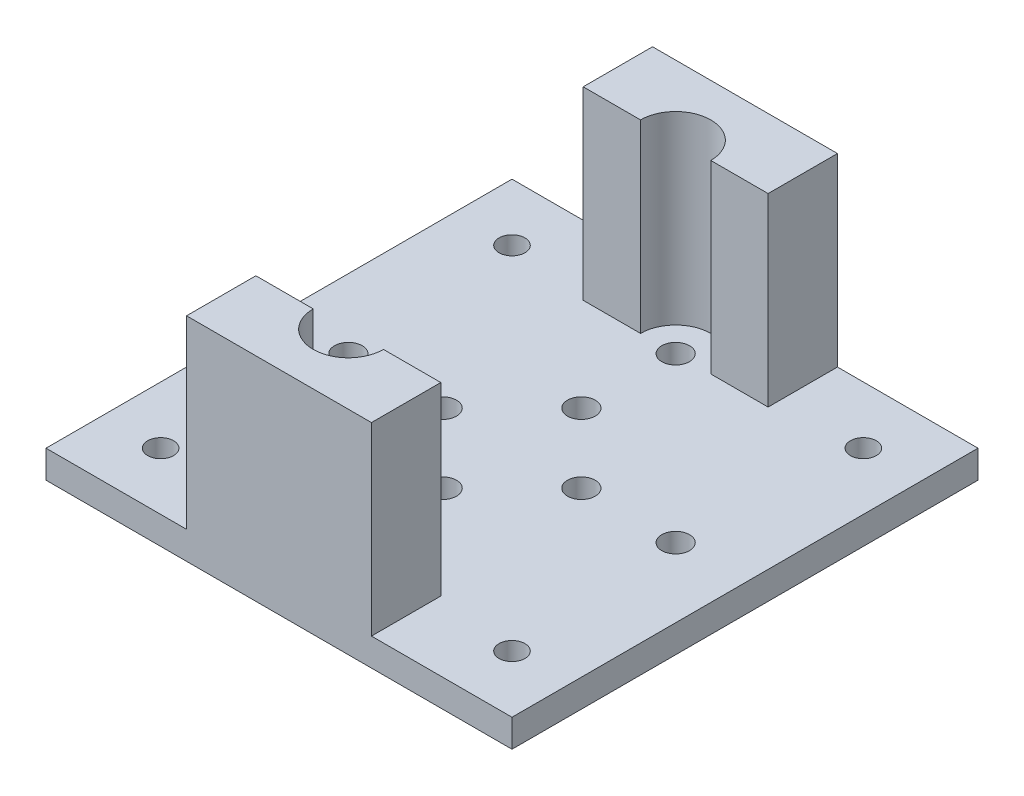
ISO-10303-21;
HEADER;
FILE_DESCRIPTION(('STEP AP214'),'2;1');
FILE_NAME('part.step','',(''),(''),'','','');
FILE_SCHEMA(('AUTOMOTIVE_DESIGN { 1 0 10303 214 1 1 1 1 }'));
ENDSEC;
DATA;
#1=APPLICATION_CONTEXT('core data for automotive mechanical design processes');
#2=APPLICATION_PROTOCOL_DEFINITION('international standard','automotive_design',2000,#1);
#3=PRODUCT_CONTEXT('',#1,'mechanical');
#4=PRODUCT('Part','Part','',(#3));
#5=PRODUCT_RELATED_PRODUCT_CATEGORY('part','',(#4));
#6=PRODUCT_DEFINITION_FORMATION('','',#4);
#7=PRODUCT_DEFINITION_CONTEXT('part definition',#1,'design');
#8=PRODUCT_DEFINITION('design','',#6,#7);
#9=PRODUCT_DEFINITION_SHAPE('','',#8);
#10=(LENGTH_UNIT() NAMED_UNIT(*) SI_UNIT(.MILLI.,.METRE.));
#11=(NAMED_UNIT(*) PLANE_ANGLE_UNIT() SI_UNIT($,.RADIAN.));
#12=(NAMED_UNIT(*) SI_UNIT($,.STERADIAN.) SOLID_ANGLE_UNIT());
#13=UNCERTAINTY_MEASURE_WITH_UNIT(LENGTH_MEASURE(1.E-05),#10,'distance_accuracy_value','');
#14=(GEOMETRIC_REPRESENTATION_CONTEXT(3) GLOBAL_UNCERTAINTY_ASSIGNED_CONTEXT((#13)) GLOBAL_UNIT_ASSIGNED_CONTEXT((#10,
#11,#12)) REPRESENTATION_CONTEXT('',''));
#15=CARTESIAN_POINT('',(0.,0.,0.));
#16=DIRECTION('',(0.,0.,1.));
#17=DIRECTION('',(1.,0.,0.));
#18=AXIS2_PLACEMENT_3D('',#15,#16,#17);
#19=CARTESIAN_POINT('',(0.,0.,0.));
#20=DIRECTION('',(0.,1.,0.));
#21=DIRECTION('',(0.,0.,1.));
#22=AXIS2_PLACEMENT_3D('',#19,#20,#21);
#23=PLANE('',#22);
#24=CARTESIAN_POINT('',(0.,0.,-7.5));
#25=DIRECTION('',(0.,1.,0.));
#26=DIRECTION('',(0.,0.,1.));
#27=AXIS2_PLACEMENT_3D('',#24,#25,#26);
#28=CIRCLE('',#27,1.5);
#29=CARTESIAN_POINT('',(0.,0.,-6.));
#30=VERTEX_POINT('',#29);
#31=EDGE_CURVE('E305',#30,#30,#28,.T.);
#32=ORIENTED_EDGE('',*,*,#31,.F.);
#33=EDGE_LOOP('',(#32));
#34=FACE_BOUND('',#33,.T.);
#35=CARTESIAN_POINT('',(7.5,0.,0.));
#36=DIRECTION('',(0.,1.,0.));
#37=DIRECTION('',(0.,0.,1.));
#38=AXIS2_PLACEMENT_3D('',#35,#36,#37);
#39=CIRCLE('',#38,1.5);
#40=CARTESIAN_POINT('',(7.5,0.,1.50000000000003));
#41=VERTEX_POINT('',#40);
#42=EDGE_CURVE('E368',#41,#41,#39,.T.);
#43=ORIENTED_EDGE('',*,*,#42,.F.);
#44=EDGE_LOOP('',(#43));
#45=FACE_BOUND('',#44,.T.);
#46=CARTESIAN_POINT('',(0.,0.,7.5));
#47=DIRECTION('',(0.,1.,0.));
#48=DIRECTION('',(0.,0.,1.));
#49=AXIS2_PLACEMENT_3D('',#46,#47,#48);
#50=CIRCLE('',#49,1.5);
#51=CARTESIAN_POINT('',(0.,0.,9.));
#52=VERTEX_POINT('',#51);
#53=EDGE_CURVE('E365',#52,#52,#50,.T.);
#54=ORIENTED_EDGE('',*,*,#53,.F.);
#55=EDGE_LOOP('',(#54));
#56=FACE_BOUND('',#55,.T.);
#57=CARTESIAN_POINT('',(-7.5,0.,0.));
#58=DIRECTION('',(0.,1.,0.));
#59=DIRECTION('',(0.,0.,1.));
#60=AXIS2_PLACEMENT_3D('',#57,#58,#59);
#61=CIRCLE('',#60,1.5);
#62=CARTESIAN_POINT('',(-7.5,0.,1.49999999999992));
#63=VERTEX_POINT('',#62);
#64=EDGE_CURVE('E362',#63,#63,#61,.T.);
#65=ORIENTED_EDGE('',*,*,#64,.F.);
#66=EDGE_LOOP('',(#65));
#67=FACE_BOUND('',#66,.T.);
#68=CARTESIAN_POINT('',(-18.9999999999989,0.,19.));
#69=DIRECTION('',(0.,1.,0.));
#70=DIRECTION('',(0.,0.,1.));
#71=AXIS2_PLACEMENT_3D('',#68,#69,#70);
#72=CIRCLE('',#71,1.4);
#73=CARTESIAN_POINT('',(-18.9999999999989,0.,20.4));
#74=VERTEX_POINT('',#73);
#75=EDGE_CURVE('E222',#74,#74,#72,.T.);
#76=ORIENTED_EDGE('',*,*,#75,.F.);
#77=EDGE_LOOP('',(#76));
#78=FACE_BOUND('',#77,.T.);
#79=CARTESIAN_POINT('',(19.0000000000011,0.,18.9999999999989));
#80=DIRECTION('',(0.,1.,0.));
#81=DIRECTION('',(0.,0.,1.));
#82=AXIS2_PLACEMENT_3D('',#79,#80,#81);
#83=CIRCLE('',#82,1.4);
#84=CARTESIAN_POINT('',(19.0000000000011,0.,20.3999999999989));
#85=VERTEX_POINT('',#84);
#86=EDGE_CURVE('E233',#85,#85,#83,.T.);
#87=ORIENTED_EDGE('',*,*,#86,.F.);
#88=EDGE_LOOP('',(#87));
#89=FACE_BOUND('',#88,.T.);
#90=CARTESIAN_POINT('',(19.,0.,-19.0000000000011));
#91=DIRECTION('',(0.,1.,0.));
#92=DIRECTION('',(0.,0.,1.));
#93=AXIS2_PLACEMENT_3D('',#90,#91,#92);
#94=CIRCLE('',#93,1.4);
#95=CARTESIAN_POINT('',(19.,0.,-17.6000000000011));
#96=VERTEX_POINT('',#95);
#97=EDGE_CURVE('E227',#96,#96,#94,.T.);
#98=ORIENTED_EDGE('',*,*,#97,.F.);
#99=EDGE_LOOP('',(#98));
#100=FACE_BOUND('',#99,.T.);
#101=CARTESIAN_POINT('',(-19.,0.,-19.));
#102=DIRECTION('',(0.,1.,0.));
#103=DIRECTION('',(0.,0.,1.));
#104=AXIS2_PLACEMENT_3D('',#101,#102,#103);
#105=CIRCLE('',#104,1.4);
#106=CARTESIAN_POINT('',(-19.,0.,-17.6));
#107=VERTEX_POINT('',#106);
#108=EDGE_CURVE('E226',#107,#107,#105,.T.);
#109=ORIENTED_EDGE('',*,*,#108,.F.);
#110=EDGE_LOOP('',(#109));
#111=FACE_BOUND('',#110,.T.);
#112=CARTESIAN_POINT('',(0.,0.,-17.7));
#113=DIRECTION('',(0.,1.,0.));
#114=DIRECTION('',(0.,0.,1.));
#115=AXIS2_PLACEMENT_3D('',#112,#113,#114);
#116=CIRCLE('',#115,1.5);
#117=CARTESIAN_POINT('',(0.,0.,-16.2));
#118=VERTEX_POINT('',#117);
#119=EDGE_CURVE('E277',#118,#118,#116,.T.);
#120=ORIENTED_EDGE('',*,*,#119,.F.);
#121=EDGE_LOOP('',(#120));
#122=FACE_BOUND('',#121,.T.);
#123=CARTESIAN_POINT('',(17.7,0.,0.));
#124=DIRECTION('',(0.,1.,0.));
#125=DIRECTION('',(0.,0.,1.));
#126=AXIS2_PLACEMENT_3D('',#123,#124,#125);
#127=CIRCLE('',#126,1.5);
#128=CARTESIAN_POINT('',(17.7,0.,1.50000000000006));
#129=VERTEX_POINT('',#128);
#130=EDGE_CURVE('E296',#129,#129,#127,.T.);
#131=ORIENTED_EDGE('',*,*,#130,.F.);
#132=EDGE_LOOP('',(#131));
#133=FACE_BOUND('',#132,.T.);
#134=CARTESIAN_POINT('',(1.00290147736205E-12,0.,17.7));
#135=DIRECTION('',(0.,1.,0.));
#136=DIRECTION('',(0.,0.,1.));
#137=AXIS2_PLACEMENT_3D('',#134,#135,#136);
#138=CIRCLE('',#137,1.50000000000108);
#139=CARTESIAN_POINT('',(1.00290147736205E-12,0.,19.2000000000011));
#140=VERTEX_POINT('',#139);
#141=EDGE_CURVE('E293',#140,#140,#138,.T.);
#142=ORIENTED_EDGE('',*,*,#141,.F.);
#143=EDGE_LOOP('',(#142));
#144=FACE_BOUND('',#143,.T.);
#145=CARTESIAN_POINT('',(-17.6999999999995,0.,5.03064256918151E-13));
#146=DIRECTION('',(0.,1.,0.));
#147=DIRECTION('',(0.,0.,1.));
#148=AXIS2_PLACEMENT_3D('',#145,#146,#147);
#149=CIRCLE('',#148,1.50000000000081);
#150=CARTESIAN_POINT('',(-17.6999999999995,0.,1.50000000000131));
#151=VERTEX_POINT('',#150);
#152=EDGE_CURVE('E250',#151,#151,#149,.T.);
#153=ORIENTED_EDGE('',*,*,#152,.F.);
#154=EDGE_LOOP('',(#153));
#155=FACE_BOUND('',#154,.T.);
#156=DIRECTION('',(1.,0.,0.));
#157=VECTOR('',#156,1.);
#158=CARTESIAN_POINT('',(-25.2,0.,25.2));
#159=LINE('',#158,#157);
#160=CARTESIAN_POINT('',(-25.2,0.,25.2));
#161=VERTEX_POINT('',#160);
#162=CARTESIAN_POINT('',(-10.,0.,25.2));
#163=VERTEX_POINT('',#162);
#164=EDGE_CURVE('E263',#161,#163,#159,.T.);
#165=ORIENTED_EDGE('',*,*,#164,.T.);
#166=DIRECTION('',(0.,0.,1.));
#167=VECTOR('',#166,1.);
#168=CARTESIAN_POINT('',(-10.,0.,17.7));
#169=LINE('',#168,#167);
#170=CARTESIAN_POINT('',(-10.,0.,17.7));
#171=VERTEX_POINT('',#170);
#172=EDGE_CURVE('E316',#171,#163,#169,.T.);
#173=ORIENTED_EDGE('',*,*,#172,.F.);
#174=DIRECTION('',(-1.,0.,0.));
#175=VECTOR('',#174,1.);
#176=CARTESIAN_POINT('',(-3.8,0.,17.7));
#177=LINE('',#176,#175);
#178=CARTESIAN_POINT('',(-3.8,0.,17.7));
#179=VERTEX_POINT('',#178);
#180=EDGE_CURVE('E314',#179,#171,#177,.T.);
#181=ORIENTED_EDGE('',*,*,#180,.F.);
#182=CARTESIAN_POINT('',(0.,0.,17.7));
#183=DIRECTION('',(0.,-1.,0.));
#184=DIRECTION('',(0.,0.,-1.));
#185=AXIS2_PLACEMENT_3D('',#182,#183,#184);
#186=CIRCLE('',#185,3.8);
#187=CARTESIAN_POINT('',(3.8,0.,17.7));
#188=VERTEX_POINT('',#187);
#189=EDGE_CURVE('E172',#188,#179,#186,.T.);
#190=ORIENTED_EDGE('',*,*,#189,.F.);
#191=DIRECTION('',(-1.,0.,0.));
#192=VECTOR('',#191,1.);
#193=CARTESIAN_POINT('',(10.,0.,17.7));
#194=LINE('',#193,#192);
#195=CARTESIAN_POINT('',(10.,0.,17.7));
#196=VERTEX_POINT('',#195);
#197=EDGE_CURVE('E168',#196,#188,#194,.T.);
#198=ORIENTED_EDGE('',*,*,#197,.F.);
#199=DIRECTION('',(0.,0.,-1.));
#200=VECTOR('',#199,1.);
#201=CARTESIAN_POINT('',(10.,0.,17.7));
#202=LINE('',#201,#200);
#203=CARTESIAN_POINT('',(10.,0.,25.2));
#204=VERTEX_POINT('',#203);
#205=EDGE_CURVE('E322',#204,#196,#202,.T.);
#206=ORIENTED_EDGE('',*,*,#205,.F.);
#207=CARTESIAN_POINT('',(25.2,0.,25.2));
#208=VERTEX_POINT('',#207);
#209=EDGE_CURVE('E283',#204,#208,#159,.T.);
#210=ORIENTED_EDGE('',*,*,#209,.T.);
#211=DIRECTION('',(0.,0.,-1.));
#212=VECTOR('',#211,1.);
#213=CARTESIAN_POINT('',(25.2,0.,-25.2));
#214=LINE('',#213,#212);
#215=CARTESIAN_POINT('',(25.2,0.,-25.2));
#216=VERTEX_POINT('',#215);
#217=EDGE_CURVE('E273',#208,#216,#214,.T.);
#218=ORIENTED_EDGE('',*,*,#217,.T.);
#219=DIRECTION('',(-1.,0.,0.));
#220=VECTOR('',#219,1.);
#221=CARTESIAN_POINT('',(-25.2,0.,-25.2));
#222=LINE('',#221,#220);
#223=CARTESIAN_POINT('',(10.,0.,-25.2));
#224=VERTEX_POINT('',#223);
#225=EDGE_CURVE('E278',#216,#224,#222,.T.);
#226=ORIENTED_EDGE('',*,*,#225,.T.);
#227=DIRECTION('',(0.,0.,-1.));
#228=VECTOR('',#227,1.);
#229=CARTESIAN_POINT('',(10.,0.,-17.7));
#230=LINE('',#229,#228);
#231=CARTESIAN_POINT('',(10.,0.,-17.7));
#232=VERTEX_POINT('',#231);
#233=EDGE_CURVE('E199',#232,#224,#230,.T.);
#234=ORIENTED_EDGE('',*,*,#233,.F.);
#235=DIRECTION('',(1.,0.,0.));
#236=VECTOR('',#235,1.);
#237=CARTESIAN_POINT('',(10.,0.,-17.7));
#238=LINE('',#237,#236);
#239=CARTESIAN_POINT('',(3.8,0.,-17.7));
#240=VERTEX_POINT('',#239);
#241=EDGE_CURVE('E177',#240,#232,#238,.T.);
#242=ORIENTED_EDGE('',*,*,#241,.F.);
#243=CARTESIAN_POINT('',(0.,0.,-17.7));
#244=DIRECTION('',(0.,-1.,0.));
#245=DIRECTION('',(0.,0.,1.));
#246=AXIS2_PLACEMENT_3D('',#243,#244,#245);
#247=CIRCLE('',#246,3.8);
#248=CARTESIAN_POINT('',(-3.8,0.,-17.7));
#249=VERTEX_POINT('',#248);
#250=EDGE_CURVE('E174',#249,#240,#247,.T.);
#251=ORIENTED_EDGE('',*,*,#250,.F.);
#252=DIRECTION('',(1.,0.,0.));
#253=VECTOR('',#252,1.);
#254=CARTESIAN_POINT('',(-3.8,0.,-17.7));
#255=LINE('',#254,#253);
#256=CARTESIAN_POINT('',(-10.,0.,-17.7));
#257=VERTEX_POINT('',#256);
#258=EDGE_CURVE('E59',#257,#249,#255,.T.);
#259=ORIENTED_EDGE('',*,*,#258,.F.);
#260=DIRECTION('',(0.,0.,1.));
#261=VECTOR('',#260,1.);
#262=CARTESIAN_POINT('',(-10.,0.,-17.7));
#263=LINE('',#262,#261);
#264=CARTESIAN_POINT('',(-10.,0.,-25.2));
#265=VERTEX_POINT('',#264);
#266=EDGE_CURVE('E202',#265,#257,#263,.T.);
#267=ORIENTED_EDGE('',*,*,#266,.F.);
#268=CARTESIAN_POINT('',(-25.2,0.,-25.2));
#269=VERTEX_POINT('',#268);
#270=EDGE_CURVE('E276',#265,#269,#222,.T.);
#271=ORIENTED_EDGE('',*,*,#270,.T.);
#272=DIRECTION('',(0.,0.,1.));
#273=VECTOR('',#272,1.);
#274=CARTESIAN_POINT('',(-25.2,0.,-25.2));
#275=LINE('',#274,#273);
#276=EDGE_CURVE('E280',#269,#161,#275,.T.);
#277=ORIENTED_EDGE('',*,*,#276,.T.);
#278=EDGE_LOOP('',(#165,#173,#181,#190,#198,#206,#210,#218,#226,#234,#242,#251,#259,#267,#271,#277));
#279=FACE_BOUND('',#278,.T.);
#280=ADVANCED_FACE('F34',(#34,#45,#56,#67,#78,#89,#100,#111,#122,#133,#144,#155,#279),#23,.T.);
#281=CARTESIAN_POINT('',(25.2,-3.,-25.2));
#282=DIRECTION('',(1.,0.,0.));
#283=DIRECTION('',(0.,0.,-1.));
#284=AXIS2_PLACEMENT_3D('',#281,#282,#283);
#285=PLANE('',#284);
#286=ORIENTED_EDGE('',*,*,#217,.F.);
#287=DIRECTION('',(0.,1.,0.));
#288=VECTOR('',#287,1.);
#289=CARTESIAN_POINT('',(25.2,-3.,25.2));
#290=LINE('',#289,#288);
#291=CARTESIAN_POINT('',(25.2,-3.,25.2));
#292=VERTEX_POINT('',#291);
#293=EDGE_CURVE('E11',#292,#208,#290,.T.);
#294=ORIENTED_EDGE('',*,*,#293,.F.);
#295=DIRECTION('',(0.,0.,-1.));
#296=VECTOR('',#295,1.);
#297=CARTESIAN_POINT('',(25.2,-3.,-25.2));
#298=LINE('',#297,#296);
#299=CARTESIAN_POINT('',(25.2,-3.,-25.2));
#300=VERTEX_POINT('',#299);
#301=EDGE_CURVE('E259',#292,#300,#298,.T.);
#302=ORIENTED_EDGE('',*,*,#301,.T.);
#303=DIRECTION('',(0.,1.,0.));
#304=VECTOR('',#303,1.);
#305=CARTESIAN_POINT('',(25.2,-3.,-25.2));
#306=LINE('',#305,#304);
#307=EDGE_CURVE('E272',#300,#216,#306,.T.);
#308=ORIENTED_EDGE('',*,*,#307,.T.);
#309=EDGE_LOOP('',(#286,#294,#302,#308));
#310=FACE_BOUND('',#309,.T.);
#311=ADVANCED_FACE('F36',(#310),#285,.T.);
#312=CARTESIAN_POINT('',(-25.2,-3.,25.2));
#313=DIRECTION('',(0.,0.,1.));
#314=DIRECTION('',(1.,0.,0.));
#315=AXIS2_PLACEMENT_3D('',#312,#313,#314);
#316=PLANE('',#315);
#317=ORIENTED_EDGE('',*,*,#164,.F.);
#318=DIRECTION('',(0.,1.,0.));
#319=VECTOR('',#318,1.);
#320=CARTESIAN_POINT('',(-25.2,-3.,25.2));
#321=LINE('',#320,#319);
#322=CARTESIAN_POINT('',(-25.2,-3.,25.2));
#323=VERTEX_POINT('',#322);
#324=EDGE_CURVE('E43',#323,#161,#321,.T.);
#325=ORIENTED_EDGE('',*,*,#324,.F.);
#326=DIRECTION('',(1.,0.,0.));
#327=VECTOR('',#326,1.);
#328=CARTESIAN_POINT('',(-25.2,-3.,25.2));
#329=LINE('',#328,#327);
#330=EDGE_CURVE('E269',#323,#292,#329,.T.);
#331=ORIENTED_EDGE('',*,*,#330,.T.);
#332=ORIENTED_EDGE('',*,*,#293,.T.);
#333=ORIENTED_EDGE('',*,*,#209,.F.);
#334=DIRECTION('',(0.,-1.,0.));
#335=VECTOR('',#334,1.);
#336=CARTESIAN_POINT('',(10.,20.,25.2));
#337=LINE('',#336,#335);
#338=CARTESIAN_POINT('',(10.,20.,25.2));
#339=VERTEX_POINT('',#338);
#340=EDGE_CURVE('E328',#339,#204,#337,.T.);
#341=ORIENTED_EDGE('',*,*,#340,.F.);
#342=DIRECTION('',(1.,0.,0.));
#343=VECTOR('',#342,1.);
#344=CARTESIAN_POINT('',(10.,20.,25.2));
#345=LINE('',#344,#343);
#346=CARTESIAN_POINT('',(-10.,20.,25.2));
#347=VERTEX_POINT('',#346);
#348=EDGE_CURVE('E336',#347,#339,#345,.T.);
#349=ORIENTED_EDGE('',*,*,#348,.F.);
#350=DIRECTION('',(0.,-1.,0.));
#351=VECTOR('',#350,1.);
#352=CARTESIAN_POINT('',(-10.,20.,25.2));
#353=LINE('',#352,#351);
#354=EDGE_CURVE('E179',#347,#163,#353,.T.);
#355=ORIENTED_EDGE('',*,*,#354,.T.);
#356=EDGE_LOOP('',(#317,#325,#331,#332,#333,#341,#349,#355));
#357=FACE_BOUND('',#356,.T.);
#358=ADVANCED_FACE('F334',(#357),#316,.T.);
#359=CARTESIAN_POINT('',(-25.2,-3.,-25.2));
#360=DIRECTION('',(-1.,0.,0.));
#361=DIRECTION('',(0.,0.,1.));
#362=AXIS2_PLACEMENT_3D('',#359,#360,#361);
#363=PLANE('',#362);
#364=ORIENTED_EDGE('',*,*,#276,.F.);
#365=DIRECTION('',(0.,1.,0.));
#366=VECTOR('',#365,1.);
#367=CARTESIAN_POINT('',(-25.2,-3.,-25.2));
#368=LINE('',#367,#366);
#369=CARTESIAN_POINT('',(-25.2,-3.,-25.2));
#370=VERTEX_POINT('',#369);
#371=EDGE_CURVE('E287',#370,#269,#368,.T.);
#372=ORIENTED_EDGE('',*,*,#371,.F.);
#373=DIRECTION('',(0.,0.,1.));
#374=VECTOR('',#373,1.);
#375=CARTESIAN_POINT('',(-25.2,-3.,-25.2));
#376=LINE('',#375,#374);
#377=EDGE_CURVE('E266',#370,#323,#376,.T.);
#378=ORIENTED_EDGE('',*,*,#377,.T.);
#379=ORIENTED_EDGE('',*,*,#324,.T.);
#380=EDGE_LOOP('',(#364,#372,#378,#379));
#381=FACE_BOUND('',#380,.T.);
#382=ADVANCED_FACE('F342',(#381),#363,.T.);
#383=CARTESIAN_POINT('',(-25.2,-3.,-25.2));
#384=DIRECTION('',(0.,0.,-1.));
#385=DIRECTION('',(-1.,0.,0.));
#386=AXIS2_PLACEMENT_3D('',#383,#384,#385);
#387=PLANE('',#386);
#388=ORIENTED_EDGE('',*,*,#225,.F.);
#389=ORIENTED_EDGE('',*,*,#307,.F.);
#390=DIRECTION('',(-1.,0.,0.));
#391=VECTOR('',#390,1.);
#392=CARTESIAN_POINT('',(-25.2,-3.,-25.2));
#393=LINE('',#392,#391);
#394=EDGE_CURVE('E262',#300,#370,#393,.T.);
#395=ORIENTED_EDGE('',*,*,#394,.T.);
#396=ORIENTED_EDGE('',*,*,#371,.T.);
#397=ORIENTED_EDGE('',*,*,#270,.F.);
#398=DIRECTION('',(0.,-1.,0.));
#399=VECTOR('',#398,1.);
#400=CARTESIAN_POINT('',(-10.,20.,-25.2));
#401=LINE('',#400,#399);
#402=CARTESIAN_POINT('',(-10.,20.,-25.2));
#403=VERTEX_POINT('',#402);
#404=EDGE_CURVE('E210',#403,#265,#401,.T.);
#405=ORIENTED_EDGE('',*,*,#404,.F.);
#406=DIRECTION('',(-1.,0.,0.));
#407=VECTOR('',#406,1.);
#408=CARTESIAN_POINT('',(10.,20.,-25.2));
#409=LINE('',#408,#407);
#410=CARTESIAN_POINT('',(10.,20.,-25.2));
#411=VERTEX_POINT('',#410);
#412=EDGE_CURVE('E190',#411,#403,#409,.T.);
#413=ORIENTED_EDGE('',*,*,#412,.F.);
#414=DIRECTION('',(0.,-1.,0.));
#415=VECTOR('',#414,1.);
#416=CARTESIAN_POINT('',(10.,20.,-25.2));
#417=LINE('',#416,#415);
#418=EDGE_CURVE('E213',#411,#224,#417,.T.);
#419=ORIENTED_EDGE('',*,*,#418,.T.);
#420=EDGE_LOOP('',(#388,#389,#395,#396,#397,#405,#413,#419));
#421=FACE_BOUND('',#420,.T.);
#422=ADVANCED_FACE('F410',(#421),#387,.T.);
#423=CARTESIAN_POINT('',(0.,-3.,0.));
#424=DIRECTION('',(0.,1.,0.));
#425=DIRECTION('',(0.,0.,1.));
#426=AXIS2_PLACEMENT_3D('',#423,#424,#425);
#427=PLANE('',#426);
#428=CARTESIAN_POINT('',(0.,-3.,-7.5));
#429=DIRECTION('',(0.,1.,0.));
#430=DIRECTION('',(0.,0.,1.));
#431=AXIS2_PLACEMENT_3D('',#428,#429,#430);
#432=CIRCLE('',#431,1.5);
#433=CARTESIAN_POINT('',(0.,-3.,-6.));
#434=VERTEX_POINT('',#433);
#435=EDGE_CURVE('E38',#434,#434,#432,.T.);
#436=ORIENTED_EDGE('',*,*,#435,.T.);
#437=EDGE_LOOP('',(#436));
#438=FACE_BOUND('',#437,.T.);
#439=CARTESIAN_POINT('',(7.5,-3.,0.));
#440=DIRECTION('',(0.,1.,0.));
#441=DIRECTION('',(0.,0.,1.));
#442=AXIS2_PLACEMENT_3D('',#439,#440,#441);
#443=CIRCLE('',#442,1.5);
#444=CARTESIAN_POINT('',(7.5,-3.,1.50000000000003));
#445=VERTEX_POINT('',#444);
#446=EDGE_CURVE('E307',#445,#445,#443,.T.);
#447=ORIENTED_EDGE('',*,*,#446,.T.);
#448=EDGE_LOOP('',(#447));
#449=FACE_BOUND('',#448,.T.);
#450=CARTESIAN_POINT('',(0.,-3.,7.5));
#451=DIRECTION('',(0.,1.,0.));
#452=DIRECTION('',(0.,0.,1.));
#453=AXIS2_PLACEMENT_3D('',#450,#451,#452);
#454=CIRCLE('',#453,1.5);
#455=CARTESIAN_POINT('',(0.,-3.,9.));
#456=VERTEX_POINT('',#455);
#457=EDGE_CURVE('E304',#456,#456,#454,.T.);
#458=ORIENTED_EDGE('',*,*,#457,.T.);
#459=EDGE_LOOP('',(#458));
#460=FACE_BOUND('',#459,.T.);
#461=CARTESIAN_POINT('',(-7.5,-3.,0.));
#462=DIRECTION('',(0.,1.,0.));
#463=DIRECTION('',(0.,0.,1.));
#464=AXIS2_PLACEMENT_3D('',#461,#462,#463);
#465=CIRCLE('',#464,1.5);
#466=CARTESIAN_POINT('',(-7.5,-3.,1.49999999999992));
#467=VERTEX_POINT('',#466);
#468=EDGE_CURVE('E301',#467,#467,#465,.T.);
#469=ORIENTED_EDGE('',*,*,#468,.T.);
#470=EDGE_LOOP('',(#469));
#471=FACE_BOUND('',#470,.T.);
#472=CARTESIAN_POINT('',(-18.9999999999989,-3.,19.));
#473=DIRECTION('',(0.,1.,0.));
#474=DIRECTION('',(0.,0.,1.));
#475=AXIS2_PLACEMENT_3D('',#472,#473,#474);
#476=CIRCLE('',#475,1.4);
#477=CARTESIAN_POINT('',(-18.9999999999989,-3.,20.4));
#478=VERTEX_POINT('',#477);
#479=EDGE_CURVE('E236',#478,#478,#476,.T.);
#480=ORIENTED_EDGE('',*,*,#479,.T.);
#481=EDGE_LOOP('',(#480));
#482=FACE_BOUND('',#481,.T.);
#483=CARTESIAN_POINT('',(19.0000000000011,-3.,18.9999999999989));
#484=DIRECTION('',(0.,1.,0.));
#485=DIRECTION('',(0.,0.,1.));
#486=AXIS2_PLACEMENT_3D('',#483,#484,#485);
#487=CIRCLE('',#486,1.4);
#488=CARTESIAN_POINT('',(19.0000000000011,-3.,20.3999999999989));
#489=VERTEX_POINT('',#488);
#490=EDGE_CURVE('E230',#489,#489,#487,.T.);
#491=ORIENTED_EDGE('',*,*,#490,.T.);
#492=EDGE_LOOP('',(#491));
#493=FACE_BOUND('',#492,.T.);
#494=CARTESIAN_POINT('',(19.,-3.,-19.0000000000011));
#495=DIRECTION('',(0.,1.,0.));
#496=DIRECTION('',(0.,0.,1.));
#497=AXIS2_PLACEMENT_3D('',#494,#495,#496);
#498=CIRCLE('',#497,1.4);
#499=CARTESIAN_POINT('',(19.,-3.,-17.6000000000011));
#500=VERTEX_POINT('',#499);
#501=EDGE_CURVE('E223',#500,#500,#498,.T.);
#502=ORIENTED_EDGE('',*,*,#501,.T.);
#503=EDGE_LOOP('',(#502));
#504=FACE_BOUND('',#503,.T.);
#505=CARTESIAN_POINT('',(-19.,-3.,-19.));
#506=DIRECTION('',(0.,1.,0.));
#507=DIRECTION('',(0.,0.,1.));
#508=AXIS2_PLACEMENT_3D('',#505,#506,#507);
#509=CIRCLE('',#508,1.4);
#510=CARTESIAN_POINT('',(-19.,-3.,-17.6));
#511=VERTEX_POINT('',#510);
#512=EDGE_CURVE('E241',#511,#511,#509,.T.);
#513=ORIENTED_EDGE('',*,*,#512,.T.);
#514=EDGE_LOOP('',(#513));
#515=FACE_BOUND('',#514,.T.);
#516=CARTESIAN_POINT('',(0.,-3.,-17.7));
#517=DIRECTION('',(0.,1.,0.));
#518=DIRECTION('',(0.,0.,1.));
#519=AXIS2_PLACEMENT_3D('',#516,#517,#518);
#520=CIRCLE('',#519,1.5);
#521=CARTESIAN_POINT('',(0.,-3.,-16.2));
#522=VERTEX_POINT('',#521);
#523=EDGE_CURVE('E247',#522,#522,#520,.T.);
#524=ORIENTED_EDGE('',*,*,#523,.T.);
#525=EDGE_LOOP('',(#524));
#526=FACE_BOUND('',#525,.T.);
#527=CARTESIAN_POINT('',(17.7,-3.,0.));
#528=DIRECTION('',(0.,1.,0.));
#529=DIRECTION('',(0.,0.,1.));
#530=AXIS2_PLACEMENT_3D('',#527,#528,#529);
#531=CIRCLE('',#530,1.5);
#532=CARTESIAN_POINT('',(17.7,-3.,1.50000000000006));
#533=VERTEX_POINT('',#532);
#534=EDGE_CURVE('E251',#533,#533,#531,.T.);
#535=ORIENTED_EDGE('',*,*,#534,.T.);
#536=EDGE_LOOP('',(#535));
#537=FACE_BOUND('',#536,.T.);
#538=CARTESIAN_POINT('',(1.00290147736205E-12,-3.,17.7));
#539=DIRECTION('',(0.,1.,0.));
#540=DIRECTION('',(0.,0.,1.));
#541=AXIS2_PLACEMENT_3D('',#538,#539,#540);
#542=CIRCLE('',#541,1.50000000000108);
#543=CARTESIAN_POINT('',(1.00290147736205E-12,-3.,19.2000000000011));
#544=VERTEX_POINT('',#543);
#545=EDGE_CURVE('E254',#544,#544,#542,.T.);
#546=ORIENTED_EDGE('',*,*,#545,.T.);
#547=EDGE_LOOP('',(#546));
#548=FACE_BOUND('',#547,.T.);
#549=CARTESIAN_POINT('',(-17.6999999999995,-3.,5.03064256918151E-13));
#550=DIRECTION('',(0.,1.,0.));
#551=DIRECTION('',(0.,0.,1.));
#552=AXIS2_PLACEMENT_3D('',#549,#550,#551);
#553=CIRCLE('',#552,1.50000000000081);
#554=CARTESIAN_POINT('',(-17.6999999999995,-3.,1.50000000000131));
#555=VERTEX_POINT('',#554);
#556=EDGE_CURVE('E244',#555,#555,#553,.T.);
#557=ORIENTED_EDGE('',*,*,#556,.T.);
#558=EDGE_LOOP('',(#557));
#559=FACE_BOUND('',#558,.T.);
#560=ORIENTED_EDGE('',*,*,#301,.F.);
#561=ORIENTED_EDGE('',*,*,#330,.F.);
#562=ORIENTED_EDGE('',*,*,#377,.F.);
#563=ORIENTED_EDGE('',*,*,#394,.F.);
#564=EDGE_LOOP('',(#560,#561,#562,#563));
#565=FACE_BOUND('',#564,.T.);
#566=ADVANCED_FACE('F349',(#438,#449,#460,#471,#482,#493,#504,#515,#526,#537,#548,#559,#565),
#427,.F.);
#567=CARTESIAN_POINT('',(-17.6999999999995,-3.,5.03064256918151E-13));
#568=DIRECTION('',(0.,1.,0.));
#569=DIRECTION('',(0.,0.,1.));
#570=AXIS2_PLACEMENT_3D('',#567,#568,#569);
#571=CYLINDRICAL_SURFACE('',#570,1.50000000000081);
#572=ORIENTED_EDGE('',*,*,#152,.T.);
#573=EDGE_LOOP('',(#572));
#574=FACE_BOUND('',#573,.T.);
#575=ORIENTED_EDGE('',*,*,#556,.F.);
#576=EDGE_LOOP('',(#575));
#577=FACE_BOUND('',#576,.T.);
#578=ADVANCED_FACE('F402',(#574,#577),#571,.F.);
#579=CARTESIAN_POINT('',(1.00290147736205E-12,-3.,17.7));
#580=DIRECTION('',(0.,1.,0.));
#581=DIRECTION('',(0.,0.,1.));
#582=AXIS2_PLACEMENT_3D('',#579,#580,#581);
#583=CYLINDRICAL_SURFACE('',#582,1.50000000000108);
#584=ORIENTED_EDGE('',*,*,#141,.T.);
#585=EDGE_LOOP('',(#584));
#586=FACE_BOUND('',#585,.T.);
#587=ORIENTED_EDGE('',*,*,#545,.F.);
#588=EDGE_LOOP('',(#587));
#589=FACE_BOUND('',#588,.T.);
#590=ADVANCED_FACE('F405',(#586,#589),#583,.F.);
#591=CARTESIAN_POINT('',(17.7,-3.,0.));
#592=DIRECTION('',(0.,1.,0.));
#593=DIRECTION('',(0.,0.,1.));
#594=AXIS2_PLACEMENT_3D('',#591,#592,#593);
#595=CYLINDRICAL_SURFACE('',#594,1.5);
#596=ORIENTED_EDGE('',*,*,#130,.T.);
#597=EDGE_LOOP('',(#596));
#598=FACE_BOUND('',#597,.T.);
#599=ORIENTED_EDGE('',*,*,#534,.F.);
#600=EDGE_LOOP('',(#599));
#601=FACE_BOUND('',#600,.T.);
#602=ADVANCED_FACE('F620',(#598,#601),#595,.F.);
#603=CARTESIAN_POINT('',(0.,-3.,-17.7));
#604=DIRECTION('',(0.,1.,0.));
#605=DIRECTION('',(0.,0.,1.));
#606=AXIS2_PLACEMENT_3D('',#603,#604,#605);
#607=CYLINDRICAL_SURFACE('',#606,1.5);
#608=ORIENTED_EDGE('',*,*,#119,.T.);
#609=EDGE_LOOP('',(#608));
#610=FACE_BOUND('',#609,.T.);
#611=ORIENTED_EDGE('',*,*,#523,.F.);
#612=EDGE_LOOP('',(#611));
#613=FACE_BOUND('',#612,.T.);
#614=ADVANCED_FACE('F616',(#610,#613),#607,.F.);
#615=CARTESIAN_POINT('',(-19.,-3.,-19.));
#616=DIRECTION('',(0.,1.,0.));
#617=DIRECTION('',(0.,0.,1.));
#618=AXIS2_PLACEMENT_3D('',#615,#616,#617);
#619=CYLINDRICAL_SURFACE('',#618,1.4);
#620=ORIENTED_EDGE('',*,*,#512,.F.);
#621=EDGE_LOOP('',(#620));
#622=FACE_BOUND('',#621,.T.);
#623=ORIENTED_EDGE('',*,*,#108,.T.);
#624=EDGE_LOOP('',(#623));
#625=FACE_BOUND('',#624,.T.);
#626=ADVANCED_FACE('F607',(#622,#625),#619,.F.);
#627=CARTESIAN_POINT('',(19.,-3.,-19.0000000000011));
#628=DIRECTION('',(0.,1.,0.));
#629=DIRECTION('',(0.,0.,1.));
#630=AXIS2_PLACEMENT_3D('',#627,#628,#629);
#631=CYLINDRICAL_SURFACE('',#630,1.4);
#632=ORIENTED_EDGE('',*,*,#501,.F.);
#633=EDGE_LOOP('',(#632));
#634=FACE_BOUND('',#633,.T.);
#635=ORIENTED_EDGE('',*,*,#97,.T.);
#636=EDGE_LOOP('',(#635));
#637=FACE_BOUND('',#636,.T.);
#638=ADVANCED_FACE('F603',(#634,#637),#631,.F.);
#639=CARTESIAN_POINT('',(19.0000000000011,-3.,18.9999999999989));
#640=DIRECTION('',(0.,1.,0.));
#641=DIRECTION('',(0.,0.,1.));
#642=AXIS2_PLACEMENT_3D('',#639,#640,#641);
#643=CYLINDRICAL_SURFACE('',#642,1.4);
#644=ORIENTED_EDGE('',*,*,#490,.F.);
#645=EDGE_LOOP('',(#644));
#646=FACE_BOUND('',#645,.T.);
#647=ORIENTED_EDGE('',*,*,#86,.T.);
#648=EDGE_LOOP('',(#647));
#649=FACE_BOUND('',#648,.T.);
#650=ADVANCED_FACE('F606',(#646,#649),#643,.F.);
#651=CARTESIAN_POINT('',(-18.9999999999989,-3.,19.));
#652=DIRECTION('',(0.,1.,0.));
#653=DIRECTION('',(0.,0.,1.));
#654=AXIS2_PLACEMENT_3D('',#651,#652,#653);
#655=CYLINDRICAL_SURFACE('',#654,1.4);
#656=ORIENTED_EDGE('',*,*,#479,.F.);
#657=EDGE_LOOP('',(#656));
#658=FACE_BOUND('',#657,.T.);
#659=ORIENTED_EDGE('',*,*,#75,.T.);
#660=EDGE_LOOP('',(#659));
#661=FACE_BOUND('',#660,.T.);
#662=ADVANCED_FACE('F447',(#658,#661),#655,.F.);
#663=CARTESIAN_POINT('',(0.,20.,-17.7));
#664=DIRECTION('',(0.,-1.,0.));
#665=DIRECTION('',(0.,0.,-1.));
#666=AXIS2_PLACEMENT_3D('',#663,#664,#665);
#667=CYLINDRICAL_SURFACE('',#666,3.8);
#668=ORIENTED_EDGE('',*,*,#250,.T.);
#669=DIRECTION('',(0.,-1.,0.));
#670=VECTOR('',#669,1.);
#671=CARTESIAN_POINT('',(3.8,20.,-17.7));
#672=LINE('',#671,#670);
#673=CARTESIAN_POINT('',(3.8,20.,-17.7));
#674=VERTEX_POINT('',#673);
#675=EDGE_CURVE('E219',#674,#240,#672,.T.);
#676=ORIENTED_EDGE('',*,*,#675,.F.);
#677=CARTESIAN_POINT('',(0.,20.,-17.7));
#678=DIRECTION('',(0.,-1.,0.));
#679=DIRECTION('',(0.,0.,1.));
#680=AXIS2_PLACEMENT_3D('',#677,#678,#679);
#681=CIRCLE('',#680,3.8);
#682=CARTESIAN_POINT('',(-3.8,20.,-17.7));
#683=VERTEX_POINT('',#682);
#684=EDGE_CURVE('E183',#683,#674,#681,.T.);
#685=ORIENTED_EDGE('',*,*,#684,.F.);
#686=DIRECTION('',(0.,-1.,0.));
#687=VECTOR('',#686,1.);
#688=CARTESIAN_POINT('',(-3.8,20.,-17.7));
#689=LINE('',#688,#687);
#690=EDGE_CURVE('E195',#683,#249,#689,.T.);
#691=ORIENTED_EDGE('',*,*,#690,.T.);
#692=EDGE_LOOP('',(#668,#676,#685,#691));
#693=FACE_BOUND('',#692,.T.);
#694=ADVANCED_FACE('F442',(#693),#667,.F.);
#695=CARTESIAN_POINT('',(10.,20.,-17.7));
#696=DIRECTION('',(0.,0.,-1.));
#697=DIRECTION('',(-1.,0.,0.));
#698=AXIS2_PLACEMENT_3D('',#695,#696,#697);
#699=PLANE('',#698);
#700=ORIENTED_EDGE('',*,*,#241,.T.);
#701=DIRECTION('',(0.,-1.,0.));
#702=VECTOR('',#701,1.);
#703=CARTESIAN_POINT('',(10.,20.,-17.7));
#704=LINE('',#703,#702);
#705=CARTESIAN_POINT('',(10.,20.,-17.7));
#706=VERTEX_POINT('',#705);
#707=EDGE_CURVE('E216',#706,#232,#704,.T.);
#708=ORIENTED_EDGE('',*,*,#707,.F.);
#709=DIRECTION('',(1.,0.,0.));
#710=VECTOR('',#709,1.);
#711=CARTESIAN_POINT('',(10.,20.,-17.7));
#712=LINE('',#711,#710);
#713=EDGE_CURVE('E186',#674,#706,#712,.T.);
#714=ORIENTED_EDGE('',*,*,#713,.F.);
#715=ORIENTED_EDGE('',*,*,#675,.T.);
#716=EDGE_LOOP('',(#700,#708,#714,#715));
#717=FACE_BOUND('',#716,.T.);
#718=ADVANCED_FACE('F446',(#717),#699,.F.);
#719=CARTESIAN_POINT('',(10.,20.,-17.7));
#720=DIRECTION('',(-1.,0.,0.));
#721=DIRECTION('',(0.,0.,1.));
#722=AXIS2_PLACEMENT_3D('',#719,#720,#721);
#723=PLANE('',#722);
#724=ORIENTED_EDGE('',*,*,#233,.T.);
#725=ORIENTED_EDGE('',*,*,#418,.F.);
#726=DIRECTION('',(0.,0.,-1.));
#727=VECTOR('',#726,1.);
#728=CARTESIAN_POINT('',(10.,20.,-17.7));
#729=LINE('',#728,#727);
#730=EDGE_CURVE('E188',#706,#411,#729,.T.);
#731=ORIENTED_EDGE('',*,*,#730,.F.);
#732=ORIENTED_EDGE('',*,*,#707,.T.);
#733=EDGE_LOOP('',(#724,#725,#731,#732));
#734=FACE_BOUND('',#733,.T.);
#735=ADVANCED_FACE('F458',(#734),#723,.F.);
#736=CARTESIAN_POINT('',(-10.,20.,-17.7));
#737=DIRECTION('',(1.,0.,0.));
#738=DIRECTION('',(0.,0.,-1.));
#739=AXIS2_PLACEMENT_3D('',#736,#737,#738);
#740=PLANE('',#739);
#741=ORIENTED_EDGE('',*,*,#266,.T.);
#742=DIRECTION('',(0.,-1.,0.));
#743=VECTOR('',#742,1.);
#744=CARTESIAN_POINT('',(-10.,20.,-17.7));
#745=LINE('',#744,#743);
#746=CARTESIAN_POINT('',(-10.,20.,-17.7));
#747=VERTEX_POINT('',#746);
#748=EDGE_CURVE('E207',#747,#257,#745,.T.);
#749=ORIENTED_EDGE('',*,*,#748,.F.);
#750=DIRECTION('',(0.,0.,1.));
#751=VECTOR('',#750,1.);
#752=CARTESIAN_POINT('',(-10.,20.,-17.7));
#753=LINE('',#752,#751);
#754=EDGE_CURVE('E192',#403,#747,#753,.T.);
#755=ORIENTED_EDGE('',*,*,#754,.F.);
#756=ORIENTED_EDGE('',*,*,#404,.T.);
#757=EDGE_LOOP('',(#741,#749,#755,#756));
#758=FACE_BOUND('',#757,.T.);
#759=ADVANCED_FACE('F468',(#758),#740,.F.);
#760=CARTESIAN_POINT('',(-3.8,20.,-17.7));
#761=DIRECTION('',(0.,0.,-1.));
#762=DIRECTION('',(-1.,0.,0.));
#763=AXIS2_PLACEMENT_3D('',#760,#761,#762);
#764=PLANE('',#763);
#765=ORIENTED_EDGE('',*,*,#258,.T.);
#766=ORIENTED_EDGE('',*,*,#690,.F.);
#767=DIRECTION('',(1.,0.,0.));
#768=VECTOR('',#767,1.);
#769=CARTESIAN_POINT('',(-3.8,20.,-17.7));
#770=LINE('',#769,#768);
#771=EDGE_CURVE('E194',#747,#683,#770,.T.);
#772=ORIENTED_EDGE('',*,*,#771,.F.);
#773=ORIENTED_EDGE('',*,*,#748,.T.);
#774=EDGE_LOOP('',(#765,#766,#772,#773));
#775=FACE_BOUND('',#774,.T.);
#776=ADVANCED_FACE('F478',(#775),#764,.F.);
#777=CARTESIAN_POINT('',(0.,20.,-17.7));
#778=DIRECTION('',(0.,1.,0.));
#779=DIRECTION('',(0.,0.,1.));
#780=AXIS2_PLACEMENT_3D('',#777,#778,#779);
#781=PLANE('',#780);
#782=ORIENTED_EDGE('',*,*,#684,.T.);
#783=ORIENTED_EDGE('',*,*,#713,.T.);
#784=ORIENTED_EDGE('',*,*,#730,.T.);
#785=ORIENTED_EDGE('',*,*,#412,.T.);
#786=ORIENTED_EDGE('',*,*,#754,.T.);
#787=ORIENTED_EDGE('',*,*,#771,.T.);
#788=EDGE_LOOP('',(#782,#783,#784,#785,#786,#787));
#789=FACE_BOUND('',#788,.T.);
#790=ADVANCED_FACE('F488',(#789),#781,.T.);
#791=CARTESIAN_POINT('',(0.,20.,17.7));
#792=DIRECTION('',(0.,-1.,0.));
#793=DIRECTION('',(0.,0.,-1.));
#794=AXIS2_PLACEMENT_3D('',#791,#792,#793);
#795=CYLINDRICAL_SURFACE('',#794,3.8);
#796=ORIENTED_EDGE('',*,*,#189,.T.);
#797=DIRECTION('',(0.,-1.,0.));
#798=VECTOR('',#797,1.);
#799=CARTESIAN_POINT('',(-3.8,20.,17.7));
#800=LINE('',#799,#798);
#801=CARTESIAN_POINT('',(-3.8,20.,17.7));
#802=VERTEX_POINT('',#801);
#803=EDGE_CURVE('E153',#802,#179,#800,.T.);
#804=ORIENTED_EDGE('',*,*,#803,.F.);
#805=CARTESIAN_POINT('',(0.,20.,17.7));
#806=DIRECTION('',(0.,-1.,0.));
#807=DIRECTION('',(0.,0.,-1.));
#808=AXIS2_PLACEMENT_3D('',#805,#806,#807);
#809=CIRCLE('',#808,3.8);
#810=CARTESIAN_POINT('',(3.8,20.,17.7));
#811=VERTEX_POINT('',#810);
#812=EDGE_CURVE('E160',#811,#802,#809,.T.);
#813=ORIENTED_EDGE('',*,*,#812,.F.);
#814=DIRECTION('',(0.,-1.,0.));
#815=VECTOR('',#814,1.);
#816=CARTESIAN_POINT('',(3.8,20.,17.7));
#817=LINE('',#816,#815);
#818=EDGE_CURVE('E325',#811,#188,#817,.T.);
#819=ORIENTED_EDGE('',*,*,#818,.T.);
#820=EDGE_LOOP('',(#796,#804,#813,#819));
#821=FACE_BOUND('',#820,.T.);
#822=ADVANCED_FACE('F170',(#821),#795,.F.);
#823=CARTESIAN_POINT('',(-3.8,20.,17.7));
#824=DIRECTION('',(0.,0.,1.));
#825=DIRECTION('',(1.,0.,0.));
#826=AXIS2_PLACEMENT_3D('',#823,#824,#825);
#827=PLANE('',#826);
#828=ORIENTED_EDGE('',*,*,#180,.T.);
#829=DIRECTION('',(0.,-1.,0.));
#830=VECTOR('',#829,1.);
#831=CARTESIAN_POINT('',(-10.,20.,17.7));
#832=LINE('',#831,#830);
#833=CARTESIAN_POINT('',(-10.,20.,17.7));
#834=VERTEX_POINT('',#833);
#835=EDGE_CURVE('E156',#834,#171,#832,.T.);
#836=ORIENTED_EDGE('',*,*,#835,.F.);
#837=DIRECTION('',(-1.,0.,0.));
#838=VECTOR('',#837,1.);
#839=CARTESIAN_POINT('',(-3.8,20.,17.7));
#840=LINE('',#839,#838);
#841=EDGE_CURVE('E149',#802,#834,#840,.T.);
#842=ORIENTED_EDGE('',*,*,#841,.F.);
#843=ORIENTED_EDGE('',*,*,#803,.T.);
#844=EDGE_LOOP('',(#828,#836,#842,#843));
#845=FACE_BOUND('',#844,.T.);
#846=ADVANCED_FACE('F151',(#845),#827,.F.);
#847=CARTESIAN_POINT('',(-10.,20.,17.7));
#848=DIRECTION('',(1.,0.,0.));
#849=DIRECTION('',(0.,0.,-1.));
#850=AXIS2_PLACEMENT_3D('',#847,#848,#849);
#851=PLANE('',#850);
#852=ORIENTED_EDGE('',*,*,#172,.T.);
#853=ORIENTED_EDGE('',*,*,#354,.F.);
#854=DIRECTION('',(0.,0.,1.));
#855=VECTOR('',#854,1.);
#856=CARTESIAN_POINT('',(-10.,20.,17.7));
#857=LINE('',#856,#855);
#858=EDGE_CURVE('E159',#834,#347,#857,.T.);
#859=ORIENTED_EDGE('',*,*,#858,.F.);
#860=ORIENTED_EDGE('',*,*,#835,.T.);
#861=EDGE_LOOP('',(#852,#853,#859,#860));
#862=FACE_BOUND('',#861,.T.);
#863=ADVANCED_FACE('F515',(#862),#851,.F.);
#864=CARTESIAN_POINT('',(10.,20.,17.7));
#865=DIRECTION('',(-1.,0.,0.));
#866=DIRECTION('',(0.,0.,1.));
#867=AXIS2_PLACEMENT_3D('',#864,#865,#866);
#868=PLANE('',#867);
#869=ORIENTED_EDGE('',*,*,#205,.T.);
#870=DIRECTION('',(0.,-1.,0.));
#871=VECTOR('',#870,1.);
#872=CARTESIAN_POINT('',(10.,20.,17.7));
#873=LINE('',#872,#871);
#874=CARTESIAN_POINT('',(10.,20.,17.7));
#875=VERTEX_POINT('',#874);
#876=EDGE_CURVE('E51',#875,#196,#873,.T.);
#877=ORIENTED_EDGE('',*,*,#876,.F.);
#878=DIRECTION('',(0.,0.,-1.));
#879=VECTOR('',#878,1.);
#880=CARTESIAN_POINT('',(10.,20.,17.7));
#881=LINE('',#880,#879);
#882=EDGE_CURVE('E357',#339,#875,#881,.T.);
#883=ORIENTED_EDGE('',*,*,#882,.F.);
#884=ORIENTED_EDGE('',*,*,#340,.T.);
#885=EDGE_LOOP('',(#869,#877,#883,#884));
#886=FACE_BOUND('',#885,.T.);
#887=ADVANCED_FACE('F358',(#886),#868,.F.);
#888=CARTESIAN_POINT('',(10.,20.,17.7));
#889=DIRECTION('',(0.,0.,1.));
#890=DIRECTION('',(1.,0.,0.));
#891=AXIS2_PLACEMENT_3D('',#888,#889,#890);
#892=PLANE('',#891);
#893=ORIENTED_EDGE('',*,*,#197,.T.);
#894=ORIENTED_EDGE('',*,*,#818,.F.);
#895=DIRECTION('',(-1.,0.,0.));
#896=VECTOR('',#895,1.);
#897=CARTESIAN_POINT('',(10.,20.,17.7));
#898=LINE('',#897,#896);
#899=EDGE_CURVE('E164',#875,#811,#898,.T.);
#900=ORIENTED_EDGE('',*,*,#899,.F.);
#901=ORIENTED_EDGE('',*,*,#876,.T.);
#902=EDGE_LOOP('',(#893,#894,#900,#901));
#903=FACE_BOUND('',#902,.T.);
#904=ADVANCED_FACE('F532',(#903),#892,.F.);
#905=CARTESIAN_POINT('',(0.,20.,17.7));
#906=DIRECTION('',(0.,-1.,0.));
#907=DIRECTION('',(0.,0.,-1.));
#908=AXIS2_PLACEMENT_3D('',#905,#906,#907);
#909=PLANE('',#908);
#910=ORIENTED_EDGE('',*,*,#812,.T.);
#911=ORIENTED_EDGE('',*,*,#841,.T.);
#912=ORIENTED_EDGE('',*,*,#858,.T.);
#913=ORIENTED_EDGE('',*,*,#348,.T.);
#914=ORIENTED_EDGE('',*,*,#882,.T.);
#915=ORIENTED_EDGE('',*,*,#899,.T.);
#916=EDGE_LOOP('',(#910,#911,#912,#913,#914,#915));
#917=FACE_BOUND('',#916,.T.);
#918=ADVANCED_FACE('F163',(#917),#909,.F.);
#919=CARTESIAN_POINT('',(-7.5,-10.,0.));
#920=DIRECTION('',(0.,1.,0.));
#921=DIRECTION('',(0.,0.,1.));
#922=AXIS2_PLACEMENT_3D('',#919,#920,#921);
#923=CYLINDRICAL_SURFACE('',#922,1.5);
#924=ORIENTED_EDGE('',*,*,#64,.T.);
#925=EDGE_LOOP('',(#924));
#926=FACE_BOUND('',#925,.T.);
#927=ORIENTED_EDGE('',*,*,#468,.F.);
#928=EDGE_LOOP('',(#927));
#929=FACE_BOUND('',#928,.T.);
#930=ADVANCED_FACE('F549',(#926,#929),#923,.F.);
#931=CARTESIAN_POINT('',(0.,-10.,7.5));
#932=DIRECTION('',(0.,1.,0.));
#933=DIRECTION('',(0.,0.,1.));
#934=AXIS2_PLACEMENT_3D('',#931,#932,#933);
#935=CYLINDRICAL_SURFACE('',#934,1.5);
#936=ORIENTED_EDGE('',*,*,#53,.T.);
#937=EDGE_LOOP('',(#936));
#938=FACE_BOUND('',#937,.T.);
#939=ORIENTED_EDGE('',*,*,#457,.F.);
#940=EDGE_LOOP('',(#939));
#941=FACE_BOUND('',#940,.T.);
#942=ADVANCED_FACE('F570',(#938,#941),#935,.F.);
#943=CARTESIAN_POINT('',(7.5,-10.,0.));
#944=DIRECTION('',(0.,1.,0.));
#945=DIRECTION('',(0.,0.,1.));
#946=AXIS2_PLACEMENT_3D('',#943,#944,#945);
#947=CYLINDRICAL_SURFACE('',#946,1.5);
#948=ORIENTED_EDGE('',*,*,#42,.T.);
#949=EDGE_LOOP('',(#948));
#950=FACE_BOUND('',#949,.T.);
#951=ORIENTED_EDGE('',*,*,#446,.F.);
#952=EDGE_LOOP('',(#951));
#953=FACE_BOUND('',#952,.T.);
#954=ADVANCED_FACE('F580',(#950,#953),#947,.F.);
#955=CARTESIAN_POINT('',(0.,-10.,-7.5));
#956=DIRECTION('',(0.,1.,0.));
#957=DIRECTION('',(0.,0.,1.));
#958=AXIS2_PLACEMENT_3D('',#955,#956,#957);
#959=CYLINDRICAL_SURFACE('',#958,1.5);
#960=ORIENTED_EDGE('',*,*,#31,.T.);
#961=EDGE_LOOP('',(#960));
#962=FACE_BOUND('',#961,.T.);
#963=ORIENTED_EDGE('',*,*,#435,.F.);
#964=EDGE_LOOP('',(#963));
#965=FACE_BOUND('',#964,.T.);
#966=ADVANCED_FACE('F374',(#962,#965),#959,.F.);
#967=CLOSED_SHELL('',(#280,#311,#358,#382,#422,#566,#578,#590,#602,#614,#626,#638,#650,#662,
#694,#718,#735,#759,#776,#790,#822,#846,#863,#887,#904,#918,#930,#942,#954,#966));
#968=MANIFOLD_SOLID_BREP('B2',#967);
#969=ADVANCED_BREP_SHAPE_REPRESENTATION('',(#18,#968),#14);
#970=SHAPE_DEFINITION_REPRESENTATION(#9,#969);
ENDSEC;
END-ISO-10303-21;
